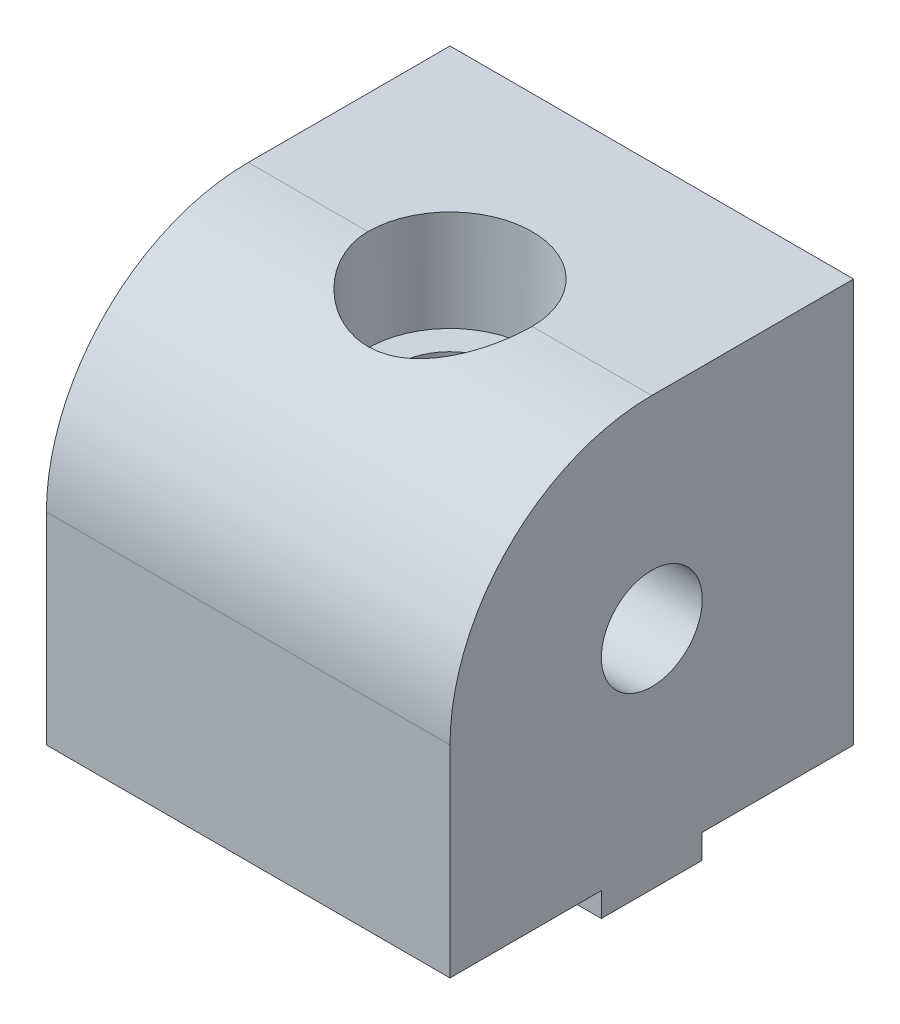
ISO-10303-21;
HEADER;
FILE_DESCRIPTION(('STEP AP214'),'2;1');
FILE_NAME('part.step','',(''),(''),'','','');
FILE_SCHEMA(('AUTOMOTIVE_DESIGN { 1 0 10303 214 1 1 1 1 }'));
ENDSEC;
DATA;
#1=APPLICATION_CONTEXT('core data for automotive mechanical design processes');
#2=APPLICATION_PROTOCOL_DEFINITION('international standard','automotive_design',2000,#1);
#3=PRODUCT_CONTEXT('',#1,'mechanical');
#4=PRODUCT('Part','Part','',(#3));
#5=PRODUCT_RELATED_PRODUCT_CATEGORY('part','',(#4));
#6=PRODUCT_DEFINITION_FORMATION('','',#4);
#7=PRODUCT_DEFINITION_CONTEXT('part definition',#1,'design');
#8=PRODUCT_DEFINITION('design','',#6,#7);
#9=PRODUCT_DEFINITION_SHAPE('','',#8);
#10=(LENGTH_UNIT() NAMED_UNIT(*) SI_UNIT(.MILLI.,.METRE.));
#11=(NAMED_UNIT(*) PLANE_ANGLE_UNIT() SI_UNIT($,.RADIAN.));
#12=(NAMED_UNIT(*) SI_UNIT($,.STERADIAN.) SOLID_ANGLE_UNIT());
#13=UNCERTAINTY_MEASURE_WITH_UNIT(LENGTH_MEASURE(1.E-05),#10,'distance_accuracy_value','');
#14=(GEOMETRIC_REPRESENTATION_CONTEXT(3) GLOBAL_UNCERTAINTY_ASSIGNED_CONTEXT((#13)) GLOBAL_UNIT_ASSIGNED_CONTEXT((#10,
#11,#12)) REPRESENTATION_CONTEXT('',''));
#15=CARTESIAN_POINT('',(0.,0.,0.));
#16=DIRECTION('',(0.,0.,1.));
#17=DIRECTION('',(1.,0.,0.));
#18=AXIS2_PLACEMENT_3D('',#15,#16,#17);
#19=CARTESIAN_POINT('',(0.,0.,0.));
#20=DIRECTION('',(0.,-1.,0.));
#21=DIRECTION('',(0.,0.,-1.));
#22=AXIS2_PLACEMENT_3D('',#19,#20,#21);
#23=PLANE('',#22);
#24=CARTESIAN_POINT('',(0.,0.,0.));
#25=DIRECTION('',(0.,1.,0.));
#26=DIRECTION('',(0.,0.,1.));
#27=AXIS2_PLACEMENT_3D('',#24,#25,#26);
#28=CIRCLE('',#27,3.3782);
#29=CARTESIAN_POINT('',(0.,0.,3.3782));
#30=VERTEX_POINT('',#29);
#31=EDGE_CURVE('E215',#30,#30,#28,.T.);
#32=ORIENTED_EDGE('',*,*,#31,.T.);
#33=EDGE_LOOP('',(#32));
#34=FACE_BOUND('',#33,.T.);
#35=DIRECTION('',(0.,0.,-1.));
#36=VECTOR('',#35,1.);
#37=CARTESIAN_POINT('',(6.35,0.,3.175));
#38=LINE('',#37,#36);
#39=CARTESIAN_POINT('',(6.35,0.,3.175));
#40=VERTEX_POINT('',#39);
#41=CARTESIAN_POINT('',(6.35,0.,-3.175));
#42=VERTEX_POINT('',#41);
#43=EDGE_CURVE('E351',#40,#42,#38,.T.);
#44=ORIENTED_EDGE('',*,*,#43,.F.);
#45=DIRECTION('',(-1.,0.,0.));
#46=VECTOR('',#45,1.);
#47=CARTESIAN_POINT('',(12.7,0.,3.175));
#48=LINE('',#47,#46);
#49=CARTESIAN_POINT('',(12.7,0.,3.175));
#50=VERTEX_POINT('',#49);
#51=EDGE_CURVE('E157',#50,#40,#48,.T.);
#52=ORIENTED_EDGE('',*,*,#51,.F.);
#53=DIRECTION('',(0.,0.,-1.));
#54=VECTOR('',#53,1.);
#55=CARTESIAN_POINT('',(12.7,0.,12.7));
#56=LINE('',#55,#54);
#57=CARTESIAN_POINT('',(12.7,0.,12.7));
#58=VERTEX_POINT('',#57);
#59=EDGE_CURVE('E229',#58,#50,#56,.T.);
#60=ORIENTED_EDGE('',*,*,#59,.F.);
#61=DIRECTION('',(1.,0.,0.));
#62=VECTOR('',#61,1.);
#63=CARTESIAN_POINT('',(-12.7,0.,12.7));
#64=LINE('',#63,#62);
#65=CARTESIAN_POINT('',(-12.7,0.,12.7));
#66=VERTEX_POINT('',#65);
#67=EDGE_CURVE('E223',#66,#58,#64,.T.);
#68=ORIENTED_EDGE('',*,*,#67,.F.);
#69=DIRECTION('',(0.,0.,1.));
#70=VECTOR('',#69,1.);
#71=CARTESIAN_POINT('',(-12.7,0.,12.7));
#72=LINE('',#71,#70);
#73=CARTESIAN_POINT('',(-12.7,0.,3.175));
#74=VERTEX_POINT('',#73);
#75=EDGE_CURVE('E234',#74,#66,#72,.T.);
#76=ORIENTED_EDGE('',*,*,#75,.F.);
#77=DIRECTION('',(-1.,0.,0.));
#78=VECTOR('',#77,1.);
#79=CARTESIAN_POINT('',(-12.7,0.,3.175));
#80=LINE('',#79,#78);
#81=CARTESIAN_POINT('',(-6.35,0.,3.175));
#82=VERTEX_POINT('',#81);
#83=EDGE_CURVE('E58',#82,#74,#80,.T.);
#84=ORIENTED_EDGE('',*,*,#83,.F.);
#85=DIRECTION('',(0.,0.,1.));
#86=VECTOR('',#85,1.);
#87=CARTESIAN_POINT('',(-6.35,0.,3.175));
#88=LINE('',#87,#86);
#89=CARTESIAN_POINT('',(-6.35,0.,-3.175));
#90=VERTEX_POINT('',#89);
#91=EDGE_CURVE('E162',#90,#82,#88,.T.);
#92=ORIENTED_EDGE('',*,*,#91,.F.);
#93=DIRECTION('',(1.,0.,0.));
#94=VECTOR('',#93,1.);
#95=CARTESIAN_POINT('',(-12.7,0.,-3.175));
#96=LINE('',#95,#94);
#97=CARTESIAN_POINT('',(-12.7,0.,-3.175));
#98=VERTEX_POINT('',#97);
#99=EDGE_CURVE('E159',#98,#90,#96,.T.);
#100=ORIENTED_EDGE('',*,*,#99,.F.);
#101=CARTESIAN_POINT('',(-12.7,0.,-12.7));
#102=VERTEX_POINT('',#101);
#103=EDGE_CURVE('E241',#102,#98,#72,.T.);
#104=ORIENTED_EDGE('',*,*,#103,.F.);
#105=DIRECTION('',(-1.,0.,0.));
#106=VECTOR('',#105,1.);
#107=CARTESIAN_POINT('',(-12.7,0.,-12.7));
#108=LINE('',#107,#106);
#109=CARTESIAN_POINT('',(12.7,0.,-12.7));
#110=VERTEX_POINT('',#109);
#111=EDGE_CURVE('E232',#110,#102,#108,.T.);
#112=ORIENTED_EDGE('',*,*,#111,.F.);
#113=CARTESIAN_POINT('',(12.7,0.,-3.175));
#114=VERTEX_POINT('',#113);
#115=EDGE_CURVE('E218',#114,#110,#56,.T.);
#116=ORIENTED_EDGE('',*,*,#115,.F.);
#117=DIRECTION('',(1.,0.,0.));
#118=VECTOR('',#117,1.);
#119=CARTESIAN_POINT('',(12.7,0.,-3.175));
#120=LINE('',#119,#118);
#121=EDGE_CURVE('E153',#42,#114,#120,.T.);
#122=ORIENTED_EDGE('',*,*,#121,.F.);
#123=EDGE_LOOP('',(#44,#52,#60,#68,#76,#84,#92,#100,#104,#112,#116,#122));
#124=FACE_BOUND('',#123,.T.);
#125=ADVANCED_FACE('F32',(#34,#124),#23,.T.);
#126=CARTESIAN_POINT('',(0.,0.,0.));
#127=DIRECTION('',(0.,1.,0.));
#128=DIRECTION('',(0.,0.,1.));
#129=AXIS2_PLACEMENT_3D('',#126,#127,#128);
#130=CYLINDRICAL_SURFACE('',#129,3.3782);
#131=ORIENTED_EDGE('',*,*,#31,.F.);
#132=EDGE_LOOP('',(#131));
#133=FACE_BOUND('',#132,.T.);
#134=CARTESIAN_POINT('',(1.15395417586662,12.7,-3.175));
#135=CARTESIAN_POINT('',(1.15399166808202,12.7821326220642,-3.17499180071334));
#136=CARTESIAN_POINT('',(1.16300427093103,12.8643329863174,-3.17175372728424));
#137=CARTESIAN_POINT('',(1.19626789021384,13.0252850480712,-3.15934216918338));
#138=CARTESIAN_POINT('',(1.22060490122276,13.104014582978,-3.15013518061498));
#139=CARTESIAN_POINT('',(1.27281416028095,13.239879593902,-3.12934320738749));
#140=CARTESIAN_POINT('',(1.298738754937,13.2979625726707,-3.11872338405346));
#141=CARTESIAN_POINT('',(1.3547833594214,13.4115177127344,-3.09479103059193));
#142=CARTESIAN_POINT('',(1.38490681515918,13.4669876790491,-3.08147628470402));
#143=CARTESIAN_POINT('',(1.47954924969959,13.6302879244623,-3.03775566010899));
#144=CARTESIAN_POINT('',(1.54820400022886,13.7347000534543,-3.00362374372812));
#145=CARTESIAN_POINT('',(1.68989432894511,13.9366079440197,-2.92627170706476));
#146=CARTESIAN_POINT('',(1.7629258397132,14.0341099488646,-2.8830599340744));
#147=CARTESIAN_POINT('',(1.91036207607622,14.2236169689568,-2.78755703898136));
#148=CARTESIAN_POINT('',(1.98476785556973,14.3156175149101,-2.73525866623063));
#149=CARTESIAN_POINT('',(2.13272769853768,14.4942693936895,-2.62152873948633));
#150=CARTESIAN_POINT('',(2.20628277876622,14.5809278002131,-2.56010964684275));
#151=CARTESIAN_POINT('',(2.35101526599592,14.7487699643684,-2.42787346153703));
#152=CARTESIAN_POINT('',(2.42219406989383,14.8299569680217,-2.35706201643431));
#153=CARTESIAN_POINT('',(2.5928540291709,15.0225205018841,-2.17068437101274));
#154=CARTESIAN_POINT('',(2.6902143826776,15.1305111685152,-2.04955784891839));
#155=CARTESIAN_POINT('',(2.87190327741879,15.3301915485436,-1.78603706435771));
#156=CARTESIAN_POINT('',(2.95625430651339,15.4219094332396,-1.64368035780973));
#157=CARTESIAN_POINT('',(3.09075667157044,15.5673610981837,-1.37026058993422));
#158=CARTESIAN_POINT('',(3.14437217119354,15.6250274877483,-1.24300788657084));
#159=CARTESIAN_POINT('',(3.2368415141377,15.7242117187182,-0.977139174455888));
#160=CARTESIAN_POINT('',(3.27570389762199,15.7657389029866,-0.838529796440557));
#161=CARTESIAN_POINT('',(3.32085060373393,15.8139152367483,-0.624190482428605));
#162=CARTESIAN_POINT('',(3.3337349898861,15.8276497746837,-0.551346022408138));
#163=CARTESIAN_POINT('',(3.35475054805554,15.8500407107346,-0.404217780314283));
#164=CARTESIAN_POINT('',(3.36288400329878,15.8586995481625,-0.329934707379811));
#165=CARTESIAN_POINT('',(3.3742010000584,15.8707454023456,-0.180581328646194));
#166=CARTESIAN_POINT('',(3.37738563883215,15.8741335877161,-0.105511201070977));
#167=CARTESIAN_POINT('',(3.37874069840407,15.8755752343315,0.0447010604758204));
#168=CARTESIAN_POINT('',(3.37691161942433,15.8736292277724,0.119843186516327));
#169=CARTESIAN_POINT('',(3.3649631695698,15.8609140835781,0.326551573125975));
#170=CARTESIAN_POINT('',(3.34959443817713,15.8445578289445,0.457543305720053));
#171=CARTESIAN_POINT('',(3.30446342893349,15.7964392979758,0.713974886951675));
#172=CARTESIAN_POINT('',(3.27469931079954,15.7646750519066,0.839414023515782));
#173=CARTESIAN_POINT('',(3.20159968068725,15.686441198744,1.08581489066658));
#174=CARTESIAN_POINT('',(3.15788740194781,15.6395629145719,1.20653304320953));
#175=CARTESIAN_POINT('',(3.0595783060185,15.5336891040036,1.43771754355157));
#176=CARTESIAN_POINT('',(3.00497585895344,15.474687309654,1.54817854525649));
#177=CARTESIAN_POINT('',(2.85654074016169,15.3133656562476,1.81269441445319));
#178=CARTESIAN_POINT('',(2.75706529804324,15.2044667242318,1.95958013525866));
#179=CARTESIAN_POINT('',(2.54513591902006,14.969095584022,2.22797327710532));
#180=CARTESIAN_POINT('',(2.43264934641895,14.8425790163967,2.34941463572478));
#181=CARTESIAN_POINT('',(2.25752892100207,14.6406094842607,2.51444905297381));
#182=CARTESIAN_POINT('',(2.19729789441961,14.5702977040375,2.56715023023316));
#183=CARTESIAN_POINT('',(2.07593621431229,14.4261017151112,2.666243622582));
#184=CARTESIAN_POINT('',(2.01480575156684,14.3522182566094,2.71263715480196));
#185=CARTESIAN_POINT('',(1.89272842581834,14.2009360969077,2.79917902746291));
#186=CARTESIAN_POINT('',(1.83178142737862,14.1235421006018,2.83933542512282));
#187=CARTESIAN_POINT('',(1.71134562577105,13.9648232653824,2.91350662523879));
#188=CARTESIAN_POINT('',(1.65185608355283,13.8835004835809,2.94752459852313));
#189=CARTESIAN_POINT('',(1.53786158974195,13.7182850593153,3.0085349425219));
#190=CARTESIAN_POINT('',(1.48326741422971,13.6345136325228,3.03568653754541));
#191=CARTESIAN_POINT('',(1.38061811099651,13.461186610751,3.08371708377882));
#192=CARTESIAN_POINT('',(1.33256040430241,13.371633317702,3.10459851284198));
#193=CARTESIAN_POINT('',(1.26095469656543,13.2117796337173,3.13421311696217));
#194=CARTESIAN_POINT('',(1.23432201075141,13.1432336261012,3.14471217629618));
#195=CARTESIAN_POINT('',(1.1911154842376,13.0026258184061,3.16133205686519));
#196=CARTESIAN_POINT('',(1.17450526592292,12.9305777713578,3.16746872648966));
#197=CARTESIAN_POINT('',(1.15463935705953,12.7832264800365,3.17477275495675));
#198=CARTESIAN_POINT('',(1.1515749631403,12.7078916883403,3.17586893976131));
#199=CARTESIAN_POINT('',(1.16021714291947,12.5581610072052,3.17271816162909));
#200=CARTESIAN_POINT('',(1.17194483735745,12.4837666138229,3.16846355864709));
#201=CARTESIAN_POINT('',(1.21108067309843,12.3224009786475,3.1537303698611));
#202=CARTESIAN_POINT('',(1.24138185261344,12.2362846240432,3.14208389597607));
#203=CARTESIAN_POINT('',(1.31275408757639,12.0695627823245,3.11294052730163));
#204=CARTESIAN_POINT('',(1.35387465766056,11.9889848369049,3.09541663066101));
#205=CARTESIAN_POINT('',(1.44625805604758,11.8253493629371,3.05342220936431));
#206=CARTESIAN_POINT('',(1.49810898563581,11.742760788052,3.02845643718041));
#207=CARTESIAN_POINT('',(1.605599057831,11.5820132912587,2.97287153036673));
#208=CARTESIAN_POINT('',(1.6612422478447,11.5038592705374,2.94224629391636));
#209=CARTESIAN_POINT('',(1.77434000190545,11.3511879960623,2.87546077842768));
#210=CARTESIAN_POINT('',(1.83179644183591,11.2766747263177,2.83929460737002));
#211=CARTESIAN_POINT('',(1.94717917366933,11.1309657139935,2.76144501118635));
#212=CARTESIAN_POINT('',(2.00510551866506,11.0597703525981,2.7197609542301));
#213=CARTESIAN_POINT('',(2.12886596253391,10.9104612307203,2.62433214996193));
#214=CARTESIAN_POINT('',(2.1946290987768,10.8328406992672,2.56971500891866));
#215=CARTESIAN_POINT('',(2.32439456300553,10.6819136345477,2.45297014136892));
#216=CARTESIAN_POINT('',(2.38839638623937,10.6086083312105,2.39084028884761));
#217=CARTESIAN_POINT('',(2.57595046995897,10.3960013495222,2.19307998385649));
#218=CARTESIAN_POINT('',(2.69548959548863,10.2634924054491,2.04575442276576));
#219=CARTESIAN_POINT('',(2.88264737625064,10.0581789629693,1.76692928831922));
#220=CARTESIAN_POINT('',(2.95525741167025,9.97921631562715,1.6432793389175));
#221=CARTESIAN_POINT('',(3.08672817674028,9.83695445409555,1.38051815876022));
#222=CARTESIAN_POINT('',(3.14560508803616,9.77363680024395,1.24142541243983));
#223=CARTESIAN_POINT('',(3.23802468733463,9.67453167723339,0.971886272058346));
#224=CARTESIAN_POINT('',(3.27404840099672,9.63603307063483,0.843296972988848));
#225=CARTESIAN_POINT('',(3.33093438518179,9.57531952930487,0.579075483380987));
#226=CARTESIAN_POINT('',(3.35180572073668,9.55309485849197,0.443447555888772));
#227=CARTESIAN_POINT('',(3.37683468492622,9.52644940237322,0.168385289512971));
#228=CARTESIAN_POINT('',(3.38093091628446,9.52209401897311,0.0289388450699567));
#229=CARTESIAN_POINT('',(3.37189247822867,9.53171162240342,-0.24875049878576));
#230=CARTESIAN_POINT('',(3.35875708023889,9.545685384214,-0.386993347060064));
#231=CARTESIAN_POINT('',(3.31757385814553,9.58957566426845,-0.650120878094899));
#232=CARTESIAN_POINT('',(3.29043355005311,9.61852219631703,-0.775315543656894));
#233=CARTESIAN_POINT('',(3.22357730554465,9.69001685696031,-1.01817366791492));
#234=CARTESIAN_POINT('',(3.18385712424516,9.73256957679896,-1.135834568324));
#235=CARTESIAN_POINT('',(3.07745024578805,9.84698562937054,-1.40324556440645));
#236=CARTESIAN_POINT('',(3.00621234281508,9.92387837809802,-1.54903679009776));
#237=CARTESIAN_POINT('',(2.84929490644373,10.0946233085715,-1.82171629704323));
#238=CARTESIAN_POINT('',(2.7635840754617,10.1885122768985,-1.94856246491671));
#239=CARTESIAN_POINT('',(2.55083934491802,10.4243229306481,-2.22377828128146));
#240=CARTESIAN_POINT('',(2.41976240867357,10.5716297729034,-2.36443244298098));
#241=CARTESIAN_POINT('',(2.21711853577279,10.8064488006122,-2.55050425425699));
#242=CARTESIAN_POINT('',(2.14850812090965,10.8871021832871,-2.60841320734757));
#243=CARTESIAN_POINT('',(2.01052361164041,11.0529694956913,-2.71618969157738));
#244=CARTESIAN_POINT('',(1.94114983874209,11.1381815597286,-2.76606047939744));
#245=CARTESIAN_POINT('',(1.78815285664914,11.332410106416,-2.8679031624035));
#246=CARTESIAN_POINT('',(1.70470615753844,11.4425780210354,-2.9179802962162));
#247=CARTESIAN_POINT('',(1.58393726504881,11.6142467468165,-2.98420899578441));
#248=CARTESIAN_POINT('',(1.54442691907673,11.672518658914,-3.00479868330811));
#249=CARTESIAN_POINT('',(1.46788187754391,11.7916189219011,-3.04292292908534));
#250=CARTESIAN_POINT('',(1.43084605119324,11.8524460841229,-3.06045888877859));
#251=CARTESIAN_POINT('',(1.35486985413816,11.987473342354,-3.09492618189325));
#252=CARTESIAN_POINT('',(1.31662506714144,12.0622229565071,-3.1112793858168));
#253=CARTESIAN_POINT('',(1.24920462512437,12.2165985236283,-3.13895732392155));
#254=CARTESIAN_POINT('',(1.22000383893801,12.2962102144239,-3.15029603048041));
#255=CARTESIAN_POINT('',(1.18395584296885,12.4304327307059,-3.16397199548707));
#256=CARTESIAN_POINT('',(1.17284435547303,12.4836909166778,-3.16808117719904));
#257=CARTESIAN_POINT('',(1.15783747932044,12.5912908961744,-3.17359550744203));
#258=CARTESIAN_POINT('',(1.15392935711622,12.6456306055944,-3.17500542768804));
#259=CARTESIAN_POINT('',(1.15395417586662,12.7,-3.175));
#260=B_SPLINE_CURVE_WITH_KNOTS('',3,(#134,#135,#136,#137,#138,#139,#140,#141,#142,#143,#144,
#145,#146,#147,#148,#149,#150,#151,#152,#153,#154,#155,#156,#157,#158,#159,#160,#161,#162,#163,
#164,#165,#166,#167,#168,#169,#170,#171,#172,#173,#174,#175,#176,#177,#178,#179,#180,#181,#182,
#183,#184,#185,#186,#187,#188,#189,#190,#191,#192,#193,#194,#195,#196,#197,#198,#199,#200,#201,
#202,#203,#204,#205,#206,#207,#208,#209,#210,#211,#212,#213,#214,#215,#216,#217,#218,#219,#220,
#221,#222,#223,#224,#225,#226,#227,#228,#229,#230,#231,#232,#233,#234,#235,#236,#237,#238,#239,
#240,#241,#242,#243,#244,#245,#246,#247,#248,#249,#250,#251,#252,#253,#254,#255,#256,#257,#258,
#259),.UNSPECIFIED.,.T.,.F.,(4,2,2,2,2,2,2,2,2,2,2,2,2,2,2,2,2,2,2,2,2,2,2,2,2,2,2,2,2,2,2,2,2,
2,2,2,2,2,2,2,2,2,2,2,2,2,2,2,2,2,2,2,2,2,2,2,2,2,2,2,2,2,4),(0.,0.246102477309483,
0.493598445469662,0.686784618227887,0.880130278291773,1.26783478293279,1.65518441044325,
2.04284455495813,2.42997984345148,2.81688339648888,3.38257562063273,3.94727875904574,
4.39451756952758,4.84149708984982,5.06693328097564,5.29226104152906,5.51753883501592,
5.74279415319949,6.13945675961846,6.53617008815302,6.94466415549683,7.35336995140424,
7.97442664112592,8.59707635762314,8.91646674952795,9.23579034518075,9.55469794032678,
9.87344032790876,10.183922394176,10.4942816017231,10.7165066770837,10.9379202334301,
11.1624508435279,11.3873024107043,11.6618558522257,11.9376883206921,12.2392312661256,
12.541101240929,12.8432944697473,13.14552233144,13.4915625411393,13.8377009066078,
14.5277481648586,15.0171959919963,15.5060641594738,15.92124174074,16.3361707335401,
16.7526170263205,17.1690809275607,17.5614302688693,17.9539121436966,18.4896211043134,
19.026503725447,19.7489620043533,20.110774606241,20.4724402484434,20.9126305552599,
21.1325792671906,21.3524267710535,21.6085817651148,21.8640184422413,22.0272198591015,
22.1901325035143),.UNSPECIFIED.);
#261=CARTESIAN_POINT('',(1.15395417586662,12.7,-3.175));
#262=VERTEX_POINT('',#261);
#263=EDGE_CURVE('E211',#262,#262,#260,.T.);
#264=ORIENTED_EDGE('',*,*,#263,.T.);
#265=EDGE_LOOP('',(#264));
#266=FACE_BOUND('',#265,.T.);
#267=CARTESIAN_POINT('',(-1.15395417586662,12.7,-3.175));
#268=CARTESIAN_POINT('',(-1.15399166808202,12.6178673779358,-3.17499180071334));
#269=CARTESIAN_POINT('',(-1.16300427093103,12.5356670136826,-3.17175372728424));
#270=CARTESIAN_POINT('',(-1.19626789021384,12.3747149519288,-3.15934216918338));
#271=CARTESIAN_POINT('',(-1.22060490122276,12.295985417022,-3.15013518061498));
#272=CARTESIAN_POINT('',(-1.27281416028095,12.160120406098,-3.12934320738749));
#273=CARTESIAN_POINT('',(-1.29873875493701,12.1020374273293,-3.11872338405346));
#274=CARTESIAN_POINT('',(-1.3547833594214,11.9884822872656,-3.09479103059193));
#275=CARTESIAN_POINT('',(-1.38490681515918,11.9330123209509,-3.08147628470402));
#276=CARTESIAN_POINT('',(-1.47954924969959,11.7697120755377,-3.03775566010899));
#277=CARTESIAN_POINT('',(-1.54820400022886,11.6652999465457,-3.00362374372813));
#278=CARTESIAN_POINT('',(-1.68989432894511,11.4633920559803,-2.92627170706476));
#279=CARTESIAN_POINT('',(-1.7629258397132,11.3658900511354,-2.8830599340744));
#280=CARTESIAN_POINT('',(-1.91036207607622,11.1763830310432,-2.78755703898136));
#281=CARTESIAN_POINT('',(-1.98476785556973,11.0843824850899,-2.73525866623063));
#282=CARTESIAN_POINT('',(-2.13272769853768,10.9057306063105,-2.62152873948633));
#283=CARTESIAN_POINT('',(-2.20628277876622,10.8190721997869,-2.56010964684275));
#284=CARTESIAN_POINT('',(-2.35101526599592,10.6512300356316,-2.42787346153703));
#285=CARTESIAN_POINT('',(-2.42219406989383,10.5700430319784,-2.35706201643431));
#286=CARTESIAN_POINT('',(-2.5928540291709,10.3774794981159,-2.17068437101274));
#287=CARTESIAN_POINT('',(-2.6902143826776,10.2694888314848,-2.04955784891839));
#288=CARTESIAN_POINT('',(-2.87190327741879,10.0698084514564,-1.78603706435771));
#289=CARTESIAN_POINT('',(-2.95625430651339,9.97809056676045,-1.64368035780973));
#290=CARTESIAN_POINT('',(-3.09075667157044,9.83263890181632,-1.37026058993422));
#291=CARTESIAN_POINT('',(-3.14437217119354,9.77497251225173,-1.24300788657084));
#292=CARTESIAN_POINT('',(-3.2368415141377,9.67578828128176,-0.977139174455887));
#293=CARTESIAN_POINT('',(-3.27570389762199,9.63426109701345,-0.838529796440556));
#294=CARTESIAN_POINT('',(-3.32085060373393,9.58608476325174,-0.624190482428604));
#295=CARTESIAN_POINT('',(-3.3337349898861,9.57235022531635,-0.551346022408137));
#296=CARTESIAN_POINT('',(-3.35475054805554,9.54995928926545,-0.404217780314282));
#297=CARTESIAN_POINT('',(-3.36288400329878,9.54130045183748,-0.32993470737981));
#298=CARTESIAN_POINT('',(-3.3742010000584,9.52925459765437,-0.180581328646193));
#299=CARTESIAN_POINT('',(-3.37738563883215,9.52586641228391,-0.105511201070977));
#300=CARTESIAN_POINT('',(-3.37874069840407,9.52442476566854,0.0447010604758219));
#301=CARTESIAN_POINT('',(-3.37691161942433,9.52637077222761,0.119843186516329));
#302=CARTESIAN_POINT('',(-3.3649631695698,9.53908591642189,0.326551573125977));
#303=CARTESIAN_POINT('',(-3.34959443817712,9.55544217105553,0.457543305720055));
#304=CARTESIAN_POINT('',(-3.30446342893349,9.60356070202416,0.713974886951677));
#305=CARTESIAN_POINT('',(-3.27469931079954,9.6353249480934,0.839414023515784));
#306=CARTESIAN_POINT('',(-3.20159968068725,9.713558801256,1.08581489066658));
#307=CARTESIAN_POINT('',(-3.15788740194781,9.76043708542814,1.20653304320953));
#308=CARTESIAN_POINT('',(-3.0595783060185,9.86631089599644,1.43771754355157));
#309=CARTESIAN_POINT('',(-3.00497585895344,9.92531269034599,1.54817854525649));
#310=CARTESIAN_POINT('',(-2.85654074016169,10.0866343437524,1.81269441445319));
#311=CARTESIAN_POINT('',(-2.75706529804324,10.1955332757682,1.95958013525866));
#312=CARTESIAN_POINT('',(-2.54513591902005,10.430904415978,2.22797327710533));
#313=CARTESIAN_POINT('',(-2.43264934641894,10.5574209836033,2.34941463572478));
#314=CARTESIAN_POINT('',(-2.25752892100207,10.7593905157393,2.51444905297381));
#315=CARTESIAN_POINT('',(-2.1972978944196,10.8297022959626,2.56715023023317));
#316=CARTESIAN_POINT('',(-2.07593621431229,10.9738982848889,2.66624362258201));
#317=CARTESIAN_POINT('',(-2.01480575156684,11.0477817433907,2.71263715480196));
#318=CARTESIAN_POINT('',(-1.89272842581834,11.1990639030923,2.79917902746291));
#319=CARTESIAN_POINT('',(-1.83178142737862,11.2764578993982,2.83933542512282));
#320=CARTESIAN_POINT('',(-1.71134562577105,11.4351767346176,2.9135066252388));
#321=CARTESIAN_POINT('',(-1.65185608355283,11.5164995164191,2.94752459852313));
#322=CARTESIAN_POINT('',(-1.53786158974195,11.6817149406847,3.0085349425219));
#323=CARTESIAN_POINT('',(-1.4832674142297,11.7654863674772,3.03568653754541));
#324=CARTESIAN_POINT('',(-1.38061811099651,11.938813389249,3.08371708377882));
#325=CARTESIAN_POINT('',(-1.33256040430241,12.028366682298,3.10459851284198));
#326=CARTESIAN_POINT('',(-1.26095469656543,12.1882203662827,3.13421311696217));
#327=CARTESIAN_POINT('',(-1.23432201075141,12.2567663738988,3.14471217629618));
#328=CARTESIAN_POINT('',(-1.1911154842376,12.3973741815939,3.16133205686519));
#329=CARTESIAN_POINT('',(-1.17450526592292,12.4694222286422,3.16746872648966));
#330=CARTESIAN_POINT('',(-1.15463935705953,12.6167735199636,3.17477275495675));
#331=CARTESIAN_POINT('',(-1.1515749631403,12.6921083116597,3.17586893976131));
#332=CARTESIAN_POINT('',(-1.16021714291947,12.8418389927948,3.17271816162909));
#333=CARTESIAN_POINT('',(-1.17194483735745,12.9162333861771,3.16846355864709));
#334=CARTESIAN_POINT('',(-1.21108067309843,13.0775990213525,3.1537303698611));
#335=CARTESIAN_POINT('',(-1.24138185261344,13.1637153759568,3.14208389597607));
#336=CARTESIAN_POINT('',(-1.31275408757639,13.3304372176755,3.11294052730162));
#337=CARTESIAN_POINT('',(-1.35387465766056,13.4110151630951,3.09541663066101));
#338=CARTESIAN_POINT('',(-1.44625805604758,13.5746506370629,3.05342220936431));
#339=CARTESIAN_POINT('',(-1.49810898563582,13.6572392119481,3.02845643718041));
#340=CARTESIAN_POINT('',(-1.60559905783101,13.8179867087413,2.97287153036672));
#341=CARTESIAN_POINT('',(-1.66124224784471,13.8961407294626,2.94224629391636));
#342=CARTESIAN_POINT('',(-1.77434000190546,14.0488120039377,2.87546077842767));
#343=CARTESIAN_POINT('',(-1.83179644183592,14.1233252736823,2.83929460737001));
#344=CARTESIAN_POINT('',(-1.94717917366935,14.2690342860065,2.76144501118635));
#345=CARTESIAN_POINT('',(-2.00510551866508,14.3402296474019,2.71976095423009));
#346=CARTESIAN_POINT('',(-2.12886596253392,14.4895387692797,2.62433214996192));
#347=CARTESIAN_POINT('',(-2.19462909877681,14.5671593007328,2.56971500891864));
#348=CARTESIAN_POINT('',(-2.32439456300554,14.7180863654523,2.45297014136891));
#349=CARTESIAN_POINT('',(-2.38839638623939,14.7913916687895,2.39084028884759));
#350=CARTESIAN_POINT('',(-2.57595046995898,15.0039986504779,2.19307998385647));
#351=CARTESIAN_POINT('',(-2.69548959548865,15.1365075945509,2.04575442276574));
#352=CARTESIAN_POINT('',(-2.88264737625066,15.3418210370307,1.7669292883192));
#353=CARTESIAN_POINT('',(-2.95525741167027,15.4207836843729,1.64327933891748));
#354=CARTESIAN_POINT('',(-3.08672817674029,15.5630455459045,1.38051815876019));
#355=CARTESIAN_POINT('',(-3.14560508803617,15.6263631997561,1.2414254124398));
#356=CARTESIAN_POINT('',(-3.23802468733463,15.7254683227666,0.97188627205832));
#357=CARTESIAN_POINT('',(-3.27404840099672,15.7639669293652,0.843296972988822));
#358=CARTESIAN_POINT('',(-3.3309343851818,15.8246804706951,0.579075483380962));
#359=CARTESIAN_POINT('',(-3.35180572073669,15.846905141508,0.443447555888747));
#360=CARTESIAN_POINT('',(-3.37683468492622,15.8735505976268,0.168385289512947));
#361=CARTESIAN_POINT('',(-3.38093091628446,15.8779059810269,0.0289388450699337));
#362=CARTESIAN_POINT('',(-3.37189247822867,15.8682883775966,-0.248750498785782));
#363=CARTESIAN_POINT('',(-3.35875708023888,15.854314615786,-0.386993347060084));
#364=CARTESIAN_POINT('',(-3.31757385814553,15.8104243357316,-0.650120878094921));
#365=CARTESIAN_POINT('',(-3.29043355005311,15.781477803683,-0.775315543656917));
#366=CARTESIAN_POINT('',(-3.22357730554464,15.7099831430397,-1.01817366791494));
#367=CARTESIAN_POINT('',(-3.18385712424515,15.667430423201,-1.13583456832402));
#368=CARTESIAN_POINT('',(-3.07745024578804,15.5530143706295,-1.40324556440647));
#369=CARTESIAN_POINT('',(-3.00621234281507,15.476121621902,-1.54903679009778));
#370=CARTESIAN_POINT('',(-2.84929490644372,15.3053766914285,-1.82171629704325));
#371=CARTESIAN_POINT('',(-2.76358407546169,15.2114877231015,-1.94856246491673));
#372=CARTESIAN_POINT('',(-2.550839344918,14.9756770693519,-2.22377828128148));
#373=CARTESIAN_POINT('',(-2.41976240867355,14.8283702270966,-2.364432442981));
#374=CARTESIAN_POINT('',(-2.21711853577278,14.5935511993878,-2.55050425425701));
#375=CARTESIAN_POINT('',(-2.14850812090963,14.5128978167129,-2.60841320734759));
#376=CARTESIAN_POINT('',(-2.01052361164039,14.3470305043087,-2.71618969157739));
#377=CARTESIAN_POINT('',(-1.94114983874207,14.2618184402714,-2.76606047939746));
#378=CARTESIAN_POINT('',(-1.78815285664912,14.067589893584,-2.86790316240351));
#379=CARTESIAN_POINT('',(-1.70470615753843,13.9574219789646,-2.91798029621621));
#380=CARTESIAN_POINT('',(-1.5839372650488,13.7857532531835,-2.98420899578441));
#381=CARTESIAN_POINT('',(-1.54442691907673,13.727481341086,-3.00479868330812));
#382=CARTESIAN_POINT('',(-1.46788187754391,13.6083810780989,-3.04292292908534));
#383=CARTESIAN_POINT('',(-1.43084605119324,13.5475539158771,-3.06045888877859));
#384=CARTESIAN_POINT('',(-1.35486985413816,13.412526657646,-3.09492618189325));
#385=CARTESIAN_POINT('',(-1.31662506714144,13.3377770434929,-3.1112793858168));
#386=CARTESIAN_POINT('',(-1.24920462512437,13.1834014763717,-3.13895732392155));
#387=CARTESIAN_POINT('',(-1.22000383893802,13.1037897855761,-3.15029603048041));
#388=CARTESIAN_POINT('',(-1.18395584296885,12.9695672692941,-3.16397199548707));
#389=CARTESIAN_POINT('',(-1.17284435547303,12.9163090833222,-3.16808117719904));
#390=CARTESIAN_POINT('',(-1.15783747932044,12.8087091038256,-3.17359550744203));
#391=CARTESIAN_POINT('',(-1.15392935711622,12.7543693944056,-3.17500542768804));
#392=CARTESIAN_POINT('',(-1.15395417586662,12.7,-3.175));
#393=B_SPLINE_CURVE_WITH_KNOTS('',3,(#267,#268,#269,#270,#271,#272,#273,#274,#275,#276,#277,
#278,#279,#280,#281,#282,#283,#284,#285,#286,#287,#288,#289,#290,#291,#292,#293,#294,#295,#296,
#297,#298,#299,#300,#301,#302,#303,#304,#305,#306,#307,#308,#309,#310,#311,#312,#313,#314,#315,
#316,#317,#318,#319,#320,#321,#322,#323,#324,#325,#326,#327,#328,#329,#330,#331,#332,#333,#334,
#335,#336,#337,#338,#339,#340,#341,#342,#343,#344,#345,#346,#347,#348,#349,#350,#351,#352,#353,
#354,#355,#356,#357,#358,#359,#360,#361,#362,#363,#364,#365,#366,#367,#368,#369,#370,#371,#372,
#373,#374,#375,#376,#377,#378,#379,#380,#381,#382,#383,#384,#385,#386,#387,#388,#389,#390,#391,
#392),.UNSPECIFIED.,.T.,.F.,(4,2,2,2,2,2,2,2,2,2,2,2,2,2,2,2,2,2,2,2,2,2,2,2,2,2,2,2,2,2,2,2,2,
2,2,2,2,2,2,2,2,2,2,2,2,2,2,2,2,2,2,2,2,2,2,2,2,2,2,2,2,2,4),(0.,0.246102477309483,
0.493598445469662,0.686784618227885,0.880130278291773,1.26783478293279,1.65518441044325,
2.04284455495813,2.42997984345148,2.81688339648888,3.38257562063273,3.94727875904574,
4.39451756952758,4.84149708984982,5.06693328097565,5.29226104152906,5.51753883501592,
5.74279415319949,6.13945675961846,6.53617008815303,6.94466415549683,7.35336995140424,
7.97442664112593,8.59707635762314,8.91646674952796,9.23579034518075,9.55469794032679,
9.87344032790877,10.183922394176,10.4942816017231,10.7165066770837,10.9379202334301,
11.1624508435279,11.3873024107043,11.6618558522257,11.9376883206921,12.2392312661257,
12.541101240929,12.8432944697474,13.1455223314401,13.4915625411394,13.8377009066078,
14.5277481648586,15.0171959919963,15.5060641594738,15.92124174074,16.3361707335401,
16.7526170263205,17.1690809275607,17.5614302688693,17.9539121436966,18.4896211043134,
19.0265037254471,19.7489620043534,20.1107746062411,20.4724402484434,20.9126305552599,
21.1325792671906,21.3524267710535,21.6085817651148,21.8640184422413,22.0272198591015,
22.1901325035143),.UNSPECIFIED.);
#394=CARTESIAN_POINT('',(-1.15395417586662,12.7,-3.175));
#395=VERTEX_POINT('',#394);
#396=EDGE_CURVE('E219',#395,#395,#393,.T.);
#397=ORIENTED_EDGE('',*,*,#396,.T.);
#398=EDGE_LOOP('',(#397));
#399=FACE_BOUND('',#398,.T.);
#400=CARTESIAN_POINT('',(0.,19.05,0.));
#401=DIRECTION('',(0.,1.,0.));
#402=DIRECTION('',(0.,0.,1.));
#403=AXIS2_PLACEMENT_3D('',#400,#401,#402);
#404=CIRCLE('',#403,3.3782);
#405=CARTESIAN_POINT('',(0.,19.05,3.3782));
#406=VERTEX_POINT('',#405);
#407=EDGE_CURVE('E206',#406,#406,#404,.F.);
#408=ORIENTED_EDGE('',*,*,#407,.F.);
#409=EDGE_LOOP('',(#408));
#410=FACE_BOUND('',#409,.T.);
#411=ADVANCED_FACE('F264',(#133,#266,#399,#410),#130,.F.);
#412=CARTESIAN_POINT('',(12.7,25.4,12.7));
#413=DIRECTION('',(-1.,0.,0.));
#414=DIRECTION('',(0.,0.,1.));
#415=AXIS2_PLACEMENT_3D('',#412,#413,#414);
#416=PLANE('',#415);
#417=CARTESIAN_POINT('',(12.7,12.7,0.));
#418=DIRECTION('',(1.,0.,0.));
#419=DIRECTION('',(0.,0.,-1.));
#420=AXIS2_PLACEMENT_3D('',#417,#418,#419);
#421=CIRCLE('',#420,3.175);
#422=CARTESIAN_POINT('',(12.7,12.7,-3.175));
#423=VERTEX_POINT('',#422);
#424=EDGE_CURVE('E212',#423,#423,#421,.T.);
#425=ORIENTED_EDGE('',*,*,#424,.F.);
#426=EDGE_LOOP('',(#425));
#427=FACE_BOUND('',#426,.T.);
#428=DIRECTION('',(0.,0.,-1.));
#429=VECTOR('',#428,1.);
#430=CARTESIAN_POINT('',(12.7,25.4,12.7));
#431=LINE('',#430,#429);
#432=CARTESIAN_POINT('',(12.7,25.4,0.));
#433=VERTEX_POINT('',#432);
#434=CARTESIAN_POINT('',(12.7,25.4,-12.7));
#435=VERTEX_POINT('',#434);
#436=EDGE_CURVE('E220',#433,#435,#431,.T.);
#437=ORIENTED_EDGE('',*,*,#436,.F.);
#438=CARTESIAN_POINT('',(12.7,12.7,0.));
#439=DIRECTION('',(-1.,0.,0.));
#440=DIRECTION('',(0.,0.,1.));
#441=AXIS2_PLACEMENT_3D('',#438,#439,#440);
#442=CIRCLE('',#441,12.7);
#443=CARTESIAN_POINT('',(12.7,12.7,12.7));
#444=VERTEX_POINT('',#443);
#445=EDGE_CURVE('E316',#433,#444,#442,.F.);
#446=ORIENTED_EDGE('',*,*,#445,.T.);
#447=DIRECTION('',(0.,-1.,0.));
#448=VECTOR('',#447,1.);
#449=CARTESIAN_POINT('',(12.7,25.4,12.7));
#450=LINE('',#449,#448);
#451=EDGE_CURVE('E228',#444,#58,#450,.T.);
#452=ORIENTED_EDGE('',*,*,#451,.T.);
#453=ORIENTED_EDGE('',*,*,#59,.T.);
#454=DIRECTION('',(0.,1.,0.));
#455=VECTOR('',#454,1.);
#456=CARTESIAN_POINT('',(12.7,-1.524,3.175));
#457=LINE('',#456,#455);
#458=CARTESIAN_POINT('',(12.7,-1.524,3.175));
#459=VERTEX_POINT('',#458);
#460=EDGE_CURVE('E358',#459,#50,#457,.T.);
#461=ORIENTED_EDGE('',*,*,#460,.F.);
#462=DIRECTION('',(0.,0.,1.));
#463=VECTOR('',#462,1.);
#464=CARTESIAN_POINT('',(12.7,-1.524,3.175));
#465=LINE('',#464,#463);
#466=CARTESIAN_POINT('',(12.7,-1.524,-3.175));
#467=VERTEX_POINT('',#466);
#468=EDGE_CURVE('E150',#467,#459,#465,.T.);
#469=ORIENTED_EDGE('',*,*,#468,.F.);
#470=DIRECTION('',(0.,1.,0.));
#471=VECTOR('',#470,1.);
#472=CARTESIAN_POINT('',(12.7,-1.524,-3.175));
#473=LINE('',#472,#471);
#474=EDGE_CURVE('E50',#467,#114,#473,.T.);
#475=ORIENTED_EDGE('',*,*,#474,.T.);
#476=ORIENTED_EDGE('',*,*,#115,.T.);
#477=DIRECTION('',(0.,-1.,0.));
#478=VECTOR('',#477,1.);
#479=CARTESIAN_POINT('',(12.7,25.4,-12.7));
#480=LINE('',#479,#478);
#481=EDGE_CURVE('E319',#435,#110,#480,.T.);
#482=ORIENTED_EDGE('',*,*,#481,.F.);
#483=EDGE_LOOP('',(#437,#446,#452,#453,#461,#469,#475,#476,#482));
#484=FACE_BOUND('',#483,.T.);
#485=ADVANCED_FACE('F294',(#427,#484),#416,.F.);
#486=CARTESIAN_POINT('',(-12.7,25.4,-12.7));
#487=DIRECTION('',(0.,0.,1.));
#488=DIRECTION('',(1.,0.,0.));
#489=AXIS2_PLACEMENT_3D('',#486,#487,#488);
#490=PLANE('',#489);
#491=ORIENTED_EDGE('',*,*,#111,.T.);
#492=DIRECTION('',(0.,-1.,0.));
#493=VECTOR('',#492,1.);
#494=CARTESIAN_POINT('',(-12.7,25.4,-12.7));
#495=LINE('',#494,#493);
#496=CARTESIAN_POINT('',(-12.7,25.4,-12.7));
#497=VERTEX_POINT('',#496);
#498=EDGE_CURVE('E328',#497,#102,#495,.T.);
#499=ORIENTED_EDGE('',*,*,#498,.F.);
#500=DIRECTION('',(-1.,0.,0.));
#501=VECTOR('',#500,1.);
#502=CARTESIAN_POINT('',(-12.7,25.4,-12.7));
#503=LINE('',#502,#501);
#504=EDGE_CURVE('E222',#435,#497,#503,.T.);
#505=ORIENTED_EDGE('',*,*,#504,.F.);
#506=ORIENTED_EDGE('',*,*,#481,.T.);
#507=EDGE_LOOP('',(#491,#499,#505,#506));
#508=FACE_BOUND('',#507,.T.);
#509=ADVANCED_FACE('F304',(#508),#490,.F.);
#510=CARTESIAN_POINT('',(-12.7,25.4,12.7));
#511=DIRECTION('',(1.,0.,0.));
#512=DIRECTION('',(0.,0.,-1.));
#513=AXIS2_PLACEMENT_3D('',#510,#511,#512);
#514=PLANE('',#513);
#515=CARTESIAN_POINT('',(-12.7,12.7,0.));
#516=DIRECTION('',(1.,0.,0.));
#517=DIRECTION('',(0.,0.,-1.));
#518=AXIS2_PLACEMENT_3D('',#515,#516,#517);
#519=CIRCLE('',#518,3.175);
#520=CARTESIAN_POINT('',(-12.7,12.7,-3.175));
#521=VERTEX_POINT('',#520);
#522=EDGE_CURVE('E208',#521,#521,#519,.T.);
#523=ORIENTED_EDGE('',*,*,#522,.T.);
#524=EDGE_LOOP('',(#523));
#525=FACE_BOUND('',#524,.T.);
#526=DIRECTION('',(0.,-1.,0.));
#527=VECTOR('',#526,1.);
#528=CARTESIAN_POINT('',(-12.7,25.4,12.7));
#529=LINE('',#528,#527);
#530=CARTESIAN_POINT('',(-12.7,12.7,12.7));
#531=VERTEX_POINT('',#530);
#532=EDGE_CURVE('E332',#531,#66,#529,.T.);
#533=ORIENTED_EDGE('',*,*,#532,.F.);
#534=CARTESIAN_POINT('',(-12.7,12.7,0.));
#535=DIRECTION('',(1.,0.,0.));
#536=DIRECTION('',(0.,0.,-1.));
#537=AXIS2_PLACEMENT_3D('',#534,#535,#536);
#538=CIRCLE('',#537,12.7);
#539=CARTESIAN_POINT('',(-12.7,25.4,0.));
#540=VERTEX_POINT('',#539);
#541=EDGE_CURVE('E42',#531,#540,#538,.F.);
#542=ORIENTED_EDGE('',*,*,#541,.T.);
#543=DIRECTION('',(0.,0.,1.));
#544=VECTOR('',#543,1.);
#545=CARTESIAN_POINT('',(-12.7,25.4,12.7));
#546=LINE('',#545,#544);
#547=EDGE_CURVE('E225',#497,#540,#546,.T.);
#548=ORIENTED_EDGE('',*,*,#547,.F.);
#549=ORIENTED_EDGE('',*,*,#498,.T.);
#550=ORIENTED_EDGE('',*,*,#103,.T.);
#551=DIRECTION('',(0.,1.,0.));
#552=VECTOR('',#551,1.);
#553=CARTESIAN_POINT('',(-12.7,-1.524,-3.175));
#554=LINE('',#553,#552);
#555=CARTESIAN_POINT('',(-12.7,-1.524,-3.175));
#556=VERTEX_POINT('',#555);
#557=EDGE_CURVE('E196',#556,#98,#554,.T.);
#558=ORIENTED_EDGE('',*,*,#557,.F.);
#559=DIRECTION('',(0.,0.,-1.));
#560=VECTOR('',#559,1.);
#561=CARTESIAN_POINT('',(-12.7,-1.524,3.175));
#562=LINE('',#561,#560);
#563=CARTESIAN_POINT('',(-12.7,-1.524,3.175));
#564=VERTEX_POINT('',#563);
#565=EDGE_CURVE('E167',#564,#556,#562,.T.);
#566=ORIENTED_EDGE('',*,*,#565,.F.);
#567=DIRECTION('',(0.,1.,0.));
#568=VECTOR('',#567,1.);
#569=CARTESIAN_POINT('',(-12.7,-1.524,3.175));
#570=LINE('',#569,#568);
#571=EDGE_CURVE('E176',#564,#74,#570,.T.);
#572=ORIENTED_EDGE('',*,*,#571,.T.);
#573=ORIENTED_EDGE('',*,*,#75,.T.);
#574=EDGE_LOOP('',(#533,#542,#548,#549,#550,#558,#566,#572,#573));
#575=FACE_BOUND('',#574,.T.);
#576=ADVANCED_FACE('F300',(#525,#575),#514,.F.);
#577=CARTESIAN_POINT('',(-12.7,25.4,12.7));
#578=DIRECTION('',(0.,0.,-1.));
#579=DIRECTION('',(-1.,0.,0.));
#580=AXIS2_PLACEMENT_3D('',#577,#578,#579);
#581=PLANE('',#580);
#582=ORIENTED_EDGE('',*,*,#451,.F.);
#583=DIRECTION('',(1.,0.,0.));
#584=VECTOR('',#583,1.);
#585=CARTESIAN_POINT('',(-12.7,12.7,12.7));
#586=LINE('',#585,#584);
#587=EDGE_CURVE('E341',#444,#531,#586,.F.);
#588=ORIENTED_EDGE('',*,*,#587,.T.);
#589=ORIENTED_EDGE('',*,*,#532,.T.);
#590=ORIENTED_EDGE('',*,*,#67,.T.);
#591=EDGE_LOOP('',(#582,#588,#589,#590));
#592=FACE_BOUND('',#591,.T.);
#593=ADVANCED_FACE('F297',(#592),#581,.F.);
#594=CARTESIAN_POINT('',(0.,25.4,0.));
#595=DIRECTION('',(0.,-1.,0.));
#596=DIRECTION('',(0.,0.,-1.));
#597=AXIS2_PLACEMENT_3D('',#594,#595,#596);
#598=PLANE('',#597);
#599=DIRECTION('',(1.,0.,0.));
#600=VECTOR('',#599,1.);
#601=CARTESIAN_POINT('',(0.,25.4,0.));
#602=LINE('',#601,#600);
#603=CARTESIAN_POINT('',(-5.1689,25.4,0.));
#604=VERTEX_POINT('',#603);
#605=EDGE_CURVE('E337',#540,#604,#602,.T.);
#606=ORIENTED_EDGE('',*,*,#605,.T.);
#607=CARTESIAN_POINT('',(0.,25.4,0.));
#608=DIRECTION('',(0.,1.,0.));
#609=DIRECTION('',(0.,0.,1.));
#610=AXIS2_PLACEMENT_3D('',#607,#608,#609);
#611=CIRCLE('',#610,5.1689);
#612=CARTESIAN_POINT('',(5.1689,25.4,0.));
#613=VERTEX_POINT('',#612);
#614=EDGE_CURVE('E201',#613,#604,#611,.T.);
#615=ORIENTED_EDGE('',*,*,#614,.F.);
#616=EDGE_CURVE('E326',#613,#433,#602,.T.);
#617=ORIENTED_EDGE('',*,*,#616,.T.);
#618=ORIENTED_EDGE('',*,*,#436,.T.);
#619=ORIENTED_EDGE('',*,*,#504,.T.);
#620=ORIENTED_EDGE('',*,*,#547,.T.);
#621=EDGE_LOOP('',(#606,#615,#617,#618,#619,#620));
#622=FACE_BOUND('',#621,.T.);
#623=ADVANCED_FACE('F286',(#622),#598,.F.);
#624=CARTESIAN_POINT('',(0.,12.7,0.));
#625=DIRECTION('',(1.,0.,0.));
#626=DIRECTION('',(0.,0.,-1.));
#627=AXIS2_PLACEMENT_3D('',#624,#625,#626);
#628=CYLINDRICAL_SURFACE('',#627,12.7);
#629=CARTESIAN_POINT('',(-5.1689,25.4,0.));
#630=CARTESIAN_POINT('',(-5.16892104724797,25.4000217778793,0.139310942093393));
#631=CARTESIAN_POINT('',(-5.16326892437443,25.3977085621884,0.278612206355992));
#632=CARTESIAN_POINT('',(-5.14077560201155,25.3885716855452,0.556118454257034));
#633=CARTESIAN_POINT('',(-5.12393779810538,25.3817493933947,0.694323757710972));
#634=CARTESIAN_POINT('',(-5.07930855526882,25.3637852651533,0.968166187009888));
#635=CARTESIAN_POINT('',(-5.05155571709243,25.3526586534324,1.10381061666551));
#636=CARTESIAN_POINT('',(-4.98538157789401,25.3263840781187,1.37207277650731));
#637=CARTESIAN_POINT('',(-4.9469598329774,25.3112359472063,1.50469038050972));
#638=CARTESIAN_POINT('',(-4.85984508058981,25.2773192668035,1.76588850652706));
#639=CARTESIAN_POINT('',(-4.81116213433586,25.2585542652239,1.89447284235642));
#640=CARTESIAN_POINT('',(-4.70392832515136,25.2178656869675,2.14695789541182));
#641=CARTESIAN_POINT('',(-4.64537377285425,25.1959409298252,2.27085684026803));
#642=CARTESIAN_POINT('',(-4.45552124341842,25.1261907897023,2.6344858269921));
#643=CARTESIAN_POINT('',(-4.31000893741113,25.0743792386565,2.86622375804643));
#644=CARTESIAN_POINT('',(-3.97816622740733,24.9626598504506,3.31248293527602));
#645=CARTESIAN_POINT('',(-3.79033086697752,24.9024972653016,3.52581047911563));
#646=CARTESIAN_POINT('',(-3.3821303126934,24.7819440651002,3.91904743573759));
#647=CARTESIAN_POINT('',(-3.16175238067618,24.7215533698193,4.09894369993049));
#648=CARTESIAN_POINT('',(-2.80523630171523,24.6343066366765,4.34400162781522));
#649=CARTESIAN_POINT('',(-2.67895046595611,24.605174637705,4.42300863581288));
#650=CARTESIAN_POINT('',(-2.41961036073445,24.549513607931,4.57003236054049));
#651=CARTESIAN_POINT('',(-2.28655891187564,24.5229835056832,4.63805360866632));
#652=CARTESIAN_POINT('',(-2.01452170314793,24.473397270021,4.76252160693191));
#653=CARTESIAN_POINT('',(-1.8755357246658,24.4503412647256,4.81896793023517));
#654=CARTESIAN_POINT('',(-1.59266522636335,24.4085229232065,4.91970194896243));
#655=CARTESIAN_POINT('',(-1.44878322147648,24.3897584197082,4.96399578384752));
#656=CARTESIAN_POINT('',(-1.16389646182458,24.3579597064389,5.038207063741));
#657=CARTESIAN_POINT('',(-1.0230648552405,24.3447012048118,5.06869313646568));
#658=CARTESIAN_POINT('',(-0.739032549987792,24.3231925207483,5.11782351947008));
#659=CARTESIAN_POINT('',(-0.59583296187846,24.3149400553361,5.13647322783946));
#660=CARTESIAN_POINT('',(-0.308197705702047,24.3037412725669,5.16172260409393));
#661=CARTESIAN_POINT('',(-0.163762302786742,24.3007938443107,5.16832479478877));
#662=CARTESIAN_POINT('',(0.12515909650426,24.3003134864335,5.16940312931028));
#663=CARTESIAN_POINT('',(0.26964509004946,24.3027802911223,5.16387986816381));
#664=CARTESIAN_POINT('',(0.546969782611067,24.3126594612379,5.14162151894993));
#665=CARTESIAN_POINT('',(0.679890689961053,24.3196987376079,5.12573187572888));
#666=CARTESIAN_POINT('',(0.943848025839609,24.3381261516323,5.08375299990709));
#667=CARTESIAN_POINT('',(1.0748838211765,24.3495157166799,5.05766041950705));
#668=CARTESIAN_POINT('',(1.3341276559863,24.3762903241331,4.99553671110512));
#669=CARTESIAN_POINT('',(1.46233640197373,24.3916743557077,4.9595080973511));
#670=CARTESIAN_POINT('',(1.71518678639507,24.425980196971,4.87784191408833));
#671=CARTESIAN_POINT('',(1.83982703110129,24.4449033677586,4.83220064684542));
#672=CARTESIAN_POINT('',(2.21228202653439,24.5070366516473,4.67933793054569));
#673=CARTESIAN_POINT('',(2.45345310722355,24.5550451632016,4.55742257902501));
#674=CARTESIAN_POINT('',(2.91269822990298,24.6585112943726,4.2785566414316));
#675=CARTESIAN_POINT('',(3.13076310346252,24.7139718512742,4.12159222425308));
#676=CARTESIAN_POINT('',(3.55616444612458,24.8315172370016,3.76228795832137));
#677=CARTESIAN_POINT('',(3.76123711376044,24.8937765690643,3.55731825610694));
#678=CARTESIAN_POINT('',(4.13491901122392,25.0141644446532,3.11507465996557));
#679=CARTESIAN_POINT('',(4.30351642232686,25.0722916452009,2.87779033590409));
#680=CARTESIAN_POINT('',(4.52688530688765,25.1523182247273,2.49940014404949));
#681=CARTESIAN_POINT('',(4.59702270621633,25.1780417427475,2.36794882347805));
#682=CARTESIAN_POINT('',(4.7258821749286,25.2260868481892,2.09899123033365));
#683=CARTESIAN_POINT('',(4.78460912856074,25.2484098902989,1.96148757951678));
#684=CARTESIAN_POINT('',(4.89002438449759,25.2889810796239,1.68152974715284));
#685=CARTESIAN_POINT('',(4.93672532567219,25.3072335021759,1.5390809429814));
#686=CARTESIAN_POINT('',(5.01766002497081,25.3391460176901,1.25024175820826));
#687=CARTESIAN_POINT('',(5.05189902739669,25.3528080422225,1.10385306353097));
#688=CARTESIAN_POINT('',(5.10931046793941,25.3758330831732,0.798781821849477));
#689=CARTESIAN_POINT('',(5.13163226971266,25.3848641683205,0.639912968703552));
#690=CARTESIAN_POINT('',(5.16143976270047,25.3969644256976,0.320699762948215));
#691=CARTESIAN_POINT('',(5.16893762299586,25.4000384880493,0.160356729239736));
#692=CARTESIAN_POINT('',(5.1689,25.4,0.));
#693=B_SPLINE_CURVE_WITH_KNOTS('',3,(#629,#630,#631,#632,#633,#634,#635,#636,#637,#638,#639,
#640,#641,#642,#643,#644,#645,#646,#647,#648,#649,#650,#651,#652,#653,#654,#655,#656,#657,#658,
#659,#660,#661,#662,#663,#664,#665,#666,#667,#668,#669,#670,#671,#672,#673,#674,#675,#676,#677,
#678,#679,#680,#681,#682,#683,#684,#685,#686,#687,#688,#689,#690,#691,#692),.UNSPECIFIED.,.F.,
.F.,(4,2,2,2,2,2,2,2,2,2,2,2,2,2,2,2,2,2,2,2,2,2,2,2,2,2,2,2,2,2,2,4),(0.,0.417783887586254,
0.835441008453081,1.25163418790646,1.66784468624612,2.08364896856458,2.49960899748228,
3.33129020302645,4.19928891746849,5.0676282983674,5.52251300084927,5.97720959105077,
6.43192294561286,6.88640615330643,7.31993725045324,7.75327048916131,8.1865129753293,
8.6197342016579,9.02141867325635,9.42323505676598,9.82494985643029,10.2268194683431,
11.0464392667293,11.866383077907,12.7521004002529,13.6381042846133,14.0912036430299,
14.5441086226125,14.9965356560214,15.4487720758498,15.9300140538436,16.4108608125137),.UNSPECIFIED.);
#694=EDGE_CURVE('E11',#604,#613,#693,.T.);
#695=ORIENTED_EDGE('',*,*,#694,.F.);
#696=ORIENTED_EDGE('',*,*,#605,.F.);
#697=ORIENTED_EDGE('',*,*,#541,.F.);
#698=ORIENTED_EDGE('',*,*,#587,.F.);
#699=ORIENTED_EDGE('',*,*,#445,.F.);
#700=ORIENTED_EDGE('',*,*,#616,.F.);
#701=EDGE_LOOP('',(#695,#696,#697,#698,#699,#700));
#702=FACE_BOUND('',#701,.T.);
#703=ADVANCED_FACE('F34',(#702),#628,.T.);
#704=CARTESIAN_POINT('',(-12.7,12.7,0.));
#705=DIRECTION('',(1.,0.,0.));
#706=DIRECTION('',(0.,0.,-1.));
#707=AXIS2_PLACEMENT_3D('',#704,#705,#706);
#708=CYLINDRICAL_SURFACE('',#707,3.175);
#709=ORIENTED_EDGE('',*,*,#424,.T.);
#710=EDGE_LOOP('',(#709));
#711=FACE_BOUND('',#710,.T.);
#712=ORIENTED_EDGE('',*,*,#263,.F.);
#713=EDGE_LOOP('',(#712));
#714=FACE_BOUND('',#713,.T.);
#715=ADVANCED_FACE('F262',(#711,#714),#708,.F.);
#716=ORIENTED_EDGE('',*,*,#522,.F.);
#717=EDGE_LOOP('',(#716));
#718=FACE_BOUND('',#717,.T.);
#719=ORIENTED_EDGE('',*,*,#396,.F.);
#720=EDGE_LOOP('',(#719));
#721=FACE_BOUND('',#720,.T.);
#722=ADVANCED_FACE('F258',(#718,#721),#708,.F.);
#723=CARTESIAN_POINT('',(0.,19.05,0.));
#724=DIRECTION('',(0.,1.,0.));
#725=DIRECTION('',(0.,0.,1.));
#726=AXIS2_PLACEMENT_3D('',#723,#724,#725);
#727=PLANE('',#726);
#728=CARTESIAN_POINT('',(0.,19.05,0.));
#729=DIRECTION('',(0.,1.,0.));
#730=DIRECTION('',(0.,0.,1.));
#731=AXIS2_PLACEMENT_3D('',#728,#729,#730);
#732=CIRCLE('',#731,5.1689);
#733=CARTESIAN_POINT('',(0.,19.05,5.1689));
#734=VERTEX_POINT('',#733);
#735=EDGE_CURVE('E203',#734,#734,#732,.T.);
#736=ORIENTED_EDGE('',*,*,#735,.T.);
#737=EDGE_LOOP('',(#736));
#738=FACE_BOUND('',#737,.T.);
#739=ORIENTED_EDGE('',*,*,#407,.T.);
#740=EDGE_LOOP('',(#739));
#741=FACE_BOUND('',#740,.T.);
#742=ADVANCED_FACE('F255',(#738,#741),#727,.T.);
#743=CARTESIAN_POINT('',(0.,19.05,0.));
#744=DIRECTION('',(0.,1.,0.));
#745=DIRECTION('',(0.,0.,1.));
#746=AXIS2_PLACEMENT_3D('',#743,#744,#745);
#747=CYLINDRICAL_SURFACE('',#746,5.1689);
#748=ORIENTED_EDGE('',*,*,#694,.T.);
#749=ORIENTED_EDGE('',*,*,#614,.T.);
#750=EDGE_LOOP('',(#748,#749));
#751=FACE_BOUND('',#750,.T.);
#752=ORIENTED_EDGE('',*,*,#735,.F.);
#753=EDGE_LOOP('',(#752));
#754=FACE_BOUND('',#753,.T.);
#755=ADVANCED_FACE('F249',(#751,#754),#747,.F.);
#756=CARTESIAN_POINT('',(-12.7,-1.524,-3.175));
#757=DIRECTION('',(0.,0.,1.));
#758=DIRECTION('',(1.,0.,0.));
#759=AXIS2_PLACEMENT_3D('',#756,#757,#758);
#760=PLANE('',#759);
#761=ORIENTED_EDGE('',*,*,#99,.T.);
#762=DIRECTION('',(0.,1.,0.));
#763=VECTOR('',#762,1.);
#764=CARTESIAN_POINT('',(-6.35,-1.524,-3.175));
#765=LINE('',#764,#763);
#766=CARTESIAN_POINT('',(-6.35,-1.524,-3.175));
#767=VERTEX_POINT('',#766);
#768=EDGE_CURVE('E191',#767,#90,#765,.T.);
#769=ORIENTED_EDGE('',*,*,#768,.F.);
#770=DIRECTION('',(1.,0.,0.));
#771=VECTOR('',#770,1.);
#772=CARTESIAN_POINT('',(-12.7,-1.524,-3.175));
#773=LINE('',#772,#771);
#774=EDGE_CURVE('E170',#556,#767,#773,.T.);
#775=ORIENTED_EDGE('',*,*,#774,.F.);
#776=ORIENTED_EDGE('',*,*,#557,.T.);
#777=EDGE_LOOP('',(#761,#769,#775,#776));
#778=FACE_BOUND('',#777,.T.);
#779=ADVANCED_FACE('F254',(#778),#760,.F.);
#780=CARTESIAN_POINT('',(-6.35,-1.524,3.175));
#781=DIRECTION('',(-1.,0.,0.));
#782=DIRECTION('',(0.,0.,1.));
#783=AXIS2_PLACEMENT_3D('',#780,#781,#782);
#784=PLANE('',#783);
#785=ORIENTED_EDGE('',*,*,#91,.T.);
#786=DIRECTION('',(0.,1.,0.));
#787=VECTOR('',#786,1.);
#788=CARTESIAN_POINT('',(-6.35,-1.524,3.175));
#789=LINE('',#788,#787);
#790=CARTESIAN_POINT('',(-6.35,-1.524,3.175));
#791=VERTEX_POINT('',#790);
#792=EDGE_CURVE('E180',#791,#82,#789,.T.);
#793=ORIENTED_EDGE('',*,*,#792,.F.);
#794=DIRECTION('',(0.,0.,1.));
#795=VECTOR('',#794,1.);
#796=CARTESIAN_POINT('',(-6.35,-1.524,3.175));
#797=LINE('',#796,#795);
#798=EDGE_CURVE('E172',#767,#791,#797,.T.);
#799=ORIENTED_EDGE('',*,*,#798,.F.);
#800=ORIENTED_EDGE('',*,*,#768,.T.);
#801=EDGE_LOOP('',(#785,#793,#799,#800));
#802=FACE_BOUND('',#801,.T.);
#803=ADVANCED_FACE('F368',(#802),#784,.F.);
#804=CARTESIAN_POINT('',(-12.7,-1.524,3.175));
#805=DIRECTION('',(0.,0.,-1.));
#806=DIRECTION('',(-1.,0.,0.));
#807=AXIS2_PLACEMENT_3D('',#804,#805,#806);
#808=PLANE('',#807);
#809=ORIENTED_EDGE('',*,*,#83,.T.);
#810=ORIENTED_EDGE('',*,*,#571,.F.);
#811=DIRECTION('',(-1.,0.,0.));
#812=VECTOR('',#811,1.);
#813=CARTESIAN_POINT('',(-12.7,-1.524,3.175));
#814=LINE('',#813,#812);
#815=EDGE_CURVE('E174',#791,#564,#814,.T.);
#816=ORIENTED_EDGE('',*,*,#815,.F.);
#817=ORIENTED_EDGE('',*,*,#792,.T.);
#818=EDGE_LOOP('',(#809,#810,#816,#817));
#819=FACE_BOUND('',#818,.T.);
#820=ADVANCED_FACE('F366',(#819),#808,.F.);
#821=CARTESIAN_POINT('',(0.,-1.524,0.));
#822=DIRECTION('',(0.,-1.,0.));
#823=DIRECTION('',(0.,0.,-1.));
#824=AXIS2_PLACEMENT_3D('',#821,#822,#823);
#825=PLANE('',#824);
#826=ORIENTED_EDGE('',*,*,#565,.T.);
#827=ORIENTED_EDGE('',*,*,#774,.T.);
#828=ORIENTED_EDGE('',*,*,#798,.T.);
#829=ORIENTED_EDGE('',*,*,#815,.T.);
#830=EDGE_LOOP('',(#826,#827,#828,#829));
#831=FACE_BOUND('',#830,.T.);
#832=ADVANCED_FACE('F365',(#831),#825,.T.);
#833=CARTESIAN_POINT('',(12.7,-1.524,3.175));
#834=DIRECTION('',(0.,0.,-1.));
#835=DIRECTION('',(-1.,0.,0.));
#836=AXIS2_PLACEMENT_3D('',#833,#834,#835);
#837=PLANE('',#836);
#838=ORIENTED_EDGE('',*,*,#51,.T.);
#839=DIRECTION('',(0.,1.,0.));
#840=VECTOR('',#839,1.);
#841=CARTESIAN_POINT('',(6.35,-1.524,3.175));
#842=LINE('',#841,#840);
#843=CARTESIAN_POINT('',(6.35,-1.524,3.175));
#844=VERTEX_POINT('',#843);
#845=EDGE_CURVE('E139',#844,#40,#842,.T.);
#846=ORIENTED_EDGE('',*,*,#845,.F.);
#847=DIRECTION('',(-1.,0.,0.));
#848=VECTOR('',#847,1.);
#849=CARTESIAN_POINT('',(12.7,-1.524,3.175));
#850=LINE('',#849,#848);
#851=EDGE_CURVE('E146',#459,#844,#850,.T.);
#852=ORIENTED_EDGE('',*,*,#851,.F.);
#853=ORIENTED_EDGE('',*,*,#460,.T.);
#854=EDGE_LOOP('',(#838,#846,#852,#853));
#855=FACE_BOUND('',#854,.T.);
#856=ADVANCED_FACE('F155',(#855),#837,.F.);
#857=CARTESIAN_POINT('',(6.35,-1.524,3.175));
#858=DIRECTION('',(1.,0.,0.));
#859=DIRECTION('',(0.,0.,-1.));
#860=AXIS2_PLACEMENT_3D('',#857,#858,#859);
#861=PLANE('',#860);
#862=ORIENTED_EDGE('',*,*,#43,.T.);
#863=DIRECTION('',(0.,1.,0.));
#864=VECTOR('',#863,1.);
#865=CARTESIAN_POINT('',(6.35,-1.524,-3.175));
#866=LINE('',#865,#864);
#867=CARTESIAN_POINT('',(6.35,-1.524,-3.175));
#868=VERTEX_POINT('',#867);
#869=EDGE_CURVE('E142',#868,#42,#866,.T.);
#870=ORIENTED_EDGE('',*,*,#869,.F.);
#871=DIRECTION('',(0.,0.,-1.));
#872=VECTOR('',#871,1.);
#873=CARTESIAN_POINT('',(6.35,-1.524,3.175));
#874=LINE('',#873,#872);
#875=EDGE_CURVE('E135',#844,#868,#874,.T.);
#876=ORIENTED_EDGE('',*,*,#875,.F.);
#877=ORIENTED_EDGE('',*,*,#845,.T.);
#878=EDGE_LOOP('',(#862,#870,#876,#877));
#879=FACE_BOUND('',#878,.T.);
#880=ADVANCED_FACE('F137',(#879),#861,.F.);
#881=CARTESIAN_POINT('',(12.7,-1.524,-3.175));
#882=DIRECTION('',(0.,0.,1.));
#883=DIRECTION('',(1.,0.,0.));
#884=AXIS2_PLACEMENT_3D('',#881,#882,#883);
#885=PLANE('',#884);
#886=ORIENTED_EDGE('',*,*,#121,.T.);
#887=ORIENTED_EDGE('',*,*,#474,.F.);
#888=DIRECTION('',(1.,0.,0.));
#889=VECTOR('',#888,1.);
#890=CARTESIAN_POINT('',(12.7,-1.524,-3.175));
#891=LINE('',#890,#889);
#892=EDGE_CURVE('E145',#868,#467,#891,.T.);
#893=ORIENTED_EDGE('',*,*,#892,.F.);
#894=ORIENTED_EDGE('',*,*,#869,.T.);
#895=EDGE_LOOP('',(#886,#887,#893,#894));
#896=FACE_BOUND('',#895,.T.);
#897=ADVANCED_FACE('F360',(#896),#885,.F.);
#898=CARTESIAN_POINT('',(0.,-1.524,0.));
#899=DIRECTION('',(0.,-1.,0.));
#900=DIRECTION('',(0.,0.,-1.));
#901=AXIS2_PLACEMENT_3D('',#898,#899,#900);
#902=PLANE('',#901);
#903=ORIENTED_EDGE('',*,*,#851,.T.);
#904=ORIENTED_EDGE('',*,*,#875,.T.);
#905=ORIENTED_EDGE('',*,*,#892,.T.);
#906=ORIENTED_EDGE('',*,*,#468,.T.);
#907=EDGE_LOOP('',(#903,#904,#905,#906));
#908=FACE_BOUND('',#907,.T.);
#909=ADVANCED_FACE('F149',(#908),#902,.T.);
#910=CLOSED_SHELL('',(#125,#411,#485,#509,#576,#593,#623,#703,#715,#722,#742,#755,#779,#803,
#820,#832,#856,#880,#897,#909));
#911=MANIFOLD_SOLID_BREP('B2',#910);
#912=ADVANCED_BREP_SHAPE_REPRESENTATION('',(#18,#911),#14);
#913=SHAPE_DEFINITION_REPRESENTATION(#9,#912);
ENDSEC;
END-ISO-10303-21;
